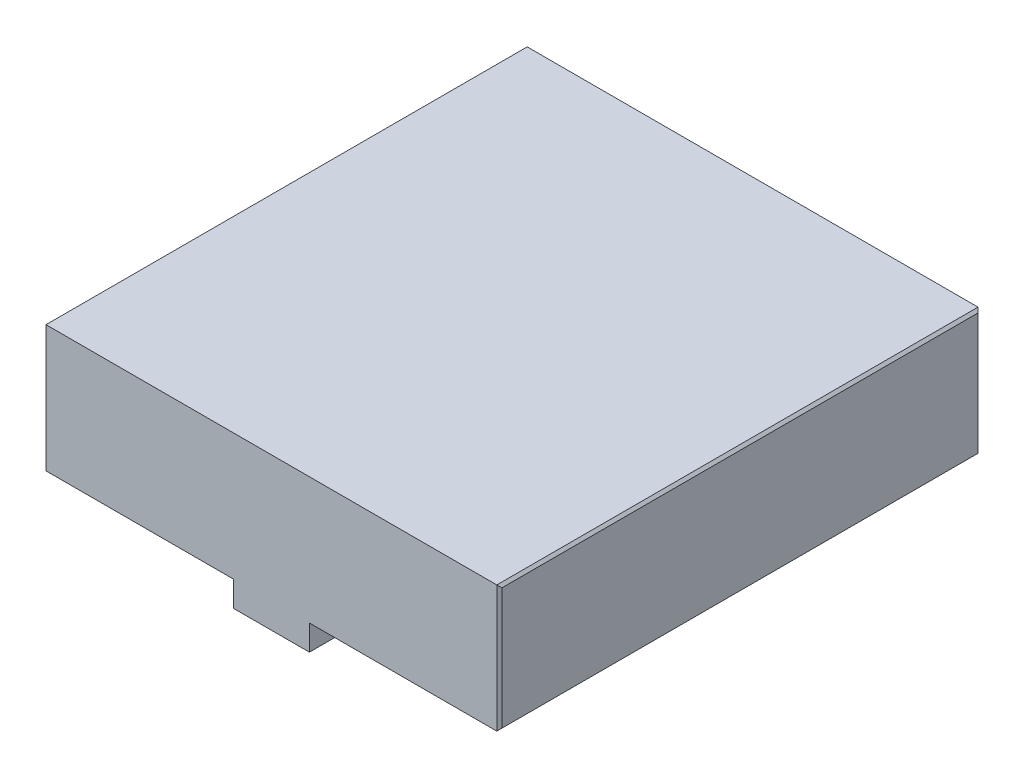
ISO-10303-21;
HEADER;
FILE_DESCRIPTION(('STEP AP214'),'2;1');
FILE_NAME('part.step','',(''),(''),'','','');
FILE_SCHEMA(('AUTOMOTIVE_DESIGN { 1 0 10303 214 1 1 1 1 }'));
ENDSEC;
DATA;
#1=APPLICATION_CONTEXT('core data for automotive mechanical design processes');
#2=APPLICATION_PROTOCOL_DEFINITION('international standard','automotive_design',2000,#1);
#3=PRODUCT_CONTEXT('',#1,'mechanical');
#4=PRODUCT('Part','Part','',(#3));
#5=PRODUCT_RELATED_PRODUCT_CATEGORY('part','',(#4));
#6=PRODUCT_DEFINITION_FORMATION('','',#4);
#7=PRODUCT_DEFINITION_CONTEXT('part definition',#1,'design');
#8=PRODUCT_DEFINITION('design','',#6,#7);
#9=PRODUCT_DEFINITION_SHAPE('','',#8);
#10=(LENGTH_UNIT() NAMED_UNIT(*) SI_UNIT(.MILLI.,.METRE.));
#11=(NAMED_UNIT(*) PLANE_ANGLE_UNIT() SI_UNIT($,.RADIAN.));
#12=(NAMED_UNIT(*) SI_UNIT($,.STERADIAN.) SOLID_ANGLE_UNIT());
#13=UNCERTAINTY_MEASURE_WITH_UNIT(LENGTH_MEASURE(1.E-05),#10,'distance_accuracy_value','');
#14=(GEOMETRIC_REPRESENTATION_CONTEXT(3) GLOBAL_UNCERTAINTY_ASSIGNED_CONTEXT((#13)) GLOBAL_UNIT_ASSIGNED_CONTEXT((#10,
#11,#12)) REPRESENTATION_CONTEXT('',''));
#15=CARTESIAN_POINT('',(0.,0.,0.));
#16=DIRECTION('',(0.,0.,1.));
#17=DIRECTION('',(1.,0.,0.));
#18=AXIS2_PLACEMENT_3D('',#15,#16,#17);
#19=CARTESIAN_POINT('',(-7.5,5.,95.));
#20=DIRECTION('',(1.,0.,0.));
#21=DIRECTION('',(0.,1.,0.));
#22=AXIS2_PLACEMENT_3D('',#19,#20,#21);
#23=PLANE('',#22);
#24=DIRECTION('',(0.,-1.,0.));
#25=VECTOR('',#24,1.);
#26=CARTESIAN_POINT('',(-7.5,5.,0.));
#27=LINE('',#26,#25);
#28=CARTESIAN_POINT('',(-7.5,5.,0.));
#29=VERTEX_POINT('',#28);
#30=CARTESIAN_POINT('',(-7.5,0.,0.));
#31=VERTEX_POINT('',#30);
#32=EDGE_CURVE('E120',#29,#31,#27,.T.);
#33=ORIENTED_EDGE('',*,*,#32,.T.);
#34=DIRECTION('',(0.,0.,-1.));
#35=VECTOR('',#34,1.);
#36=CARTESIAN_POINT('',(-7.5,0.,95.));
#37=LINE('',#36,#35);
#38=CARTESIAN_POINT('',(-7.5,0.,95.));
#39=VERTEX_POINT('',#38);
#40=EDGE_CURVE('E128',#39,#31,#37,.T.);
#41=ORIENTED_EDGE('',*,*,#40,.F.);
#42=DIRECTION('',(0.,-1.,0.));
#43=VECTOR('',#42,1.);
#44=CARTESIAN_POINT('',(-7.5,5.,95.));
#45=LINE('',#44,#43);
#46=CARTESIAN_POINT('',(-7.5,5.,95.));
#47=VERTEX_POINT('',#46);
#48=EDGE_CURVE('E156',#47,#39,#45,.T.);
#49=ORIENTED_EDGE('',*,*,#48,.F.);
#50=DIRECTION('',(0.,0.,-1.));
#51=VECTOR('',#50,1.);
#52=CARTESIAN_POINT('',(-7.5,5.,95.));
#53=LINE('',#52,#51);
#54=EDGE_CURVE('E139',#47,#29,#53,.T.);
#55=ORIENTED_EDGE('',*,*,#54,.T.);
#56=EDGE_LOOP('',(#33,#41,#49,#55));
#57=FACE_BOUND('',#56,.T.);
#58=ADVANCED_FACE('F27',(#57),#23,.F.);
#59=CARTESIAN_POINT('',(-7.5,0.,95.));
#60=DIRECTION('',(0.,1.,0.));
#61=DIRECTION('',(0.,0.,1.));
#62=AXIS2_PLACEMENT_3D('',#59,#60,#61);
#63=PLANE('',#62);
#64=DIRECTION('',(1.,0.,0.));
#65=VECTOR('',#64,1.);
#66=CARTESIAN_POINT('',(-7.5,0.,0.));
#67=LINE('',#66,#65);
#68=CARTESIAN_POINT('',(7.5,0.,0.));
#69=VERTEX_POINT('',#68);
#70=EDGE_CURVE('E114',#31,#69,#67,.T.);
#71=ORIENTED_EDGE('',*,*,#70,.T.);
#72=DIRECTION('',(0.,0.,-1.));
#73=VECTOR('',#72,1.);
#74=CARTESIAN_POINT('',(7.5,0.,95.));
#75=LINE('',#74,#73);
#76=CARTESIAN_POINT('',(7.5,0.,95.));
#77=VERTEX_POINT('',#76);
#78=EDGE_CURVE('E135',#77,#69,#75,.T.);
#79=ORIENTED_EDGE('',*,*,#78,.F.);
#80=DIRECTION('',(1.,0.,0.));
#81=VECTOR('',#80,1.);
#82=CARTESIAN_POINT('',(-7.5,0.,95.));
#83=LINE('',#82,#81);
#84=EDGE_CURVE('E130',#39,#77,#83,.T.);
#85=ORIENTED_EDGE('',*,*,#84,.F.);
#86=ORIENTED_EDGE('',*,*,#40,.T.);
#87=EDGE_LOOP('',(#71,#79,#85,#86));
#88=FACE_BOUND('',#87,.T.);
#89=ADVANCED_FACE('F129',(#88),#63,.F.);
#90=CARTESIAN_POINT('',(7.5,0.,95.));
#91=DIRECTION('',(-1.,0.,0.));
#92=DIRECTION('',(0.,-1.,0.));
#93=AXIS2_PLACEMENT_3D('',#90,#91,#92);
#94=PLANE('',#93);
#95=DIRECTION('',(0.,1.,0.));
#96=VECTOR('',#95,1.);
#97=CARTESIAN_POINT('',(7.5,0.,0.));
#98=LINE('',#97,#96);
#99=CARTESIAN_POINT('',(7.5,5.,0.));
#100=VERTEX_POINT('',#99);
#101=EDGE_CURVE('E122',#69,#100,#98,.T.);
#102=ORIENTED_EDGE('',*,*,#101,.T.);
#103=DIRECTION('',(0.,0.,-1.));
#104=VECTOR('',#103,1.);
#105=CARTESIAN_POINT('',(7.5,5.,95.));
#106=LINE('',#105,#104);
#107=CARTESIAN_POINT('',(7.5,5.,95.));
#108=VERTEX_POINT('',#107);
#109=EDGE_CURVE('E170',#108,#100,#106,.T.);
#110=ORIENTED_EDGE('',*,*,#109,.F.);
#111=DIRECTION('',(0.,1.,0.));
#112=VECTOR('',#111,1.);
#113=CARTESIAN_POINT('',(7.5,0.,95.));
#114=LINE('',#113,#112);
#115=EDGE_CURVE('E159',#77,#108,#114,.T.);
#116=ORIENTED_EDGE('',*,*,#115,.F.);
#117=ORIENTED_EDGE('',*,*,#78,.T.);
#118=EDGE_LOOP('',(#102,#110,#116,#117));
#119=FACE_BOUND('',#118,.T.);
#120=ADVANCED_FACE('F259',(#119),#94,.F.);
#121=CARTESIAN_POINT('',(7.5,5.,95.));
#122=DIRECTION('',(0.,1.,0.));
#123=DIRECTION('',(-1.,0.,0.));
#124=AXIS2_PLACEMENT_3D('',#121,#122,#123);
#125=PLANE('',#124);
#126=DIRECTION('',(1.,0.,0.));
#127=VECTOR('',#126,1.);
#128=CARTESIAN_POINT('',(7.5,5.,0.));
#129=LINE('',#128,#127);
#130=CARTESIAN_POINT('',(44.5,5.,0.));
#131=VERTEX_POINT('',#130);
#132=EDGE_CURVE('E148',#100,#131,#129,.T.);
#133=ORIENTED_EDGE('',*,*,#132,.T.);
#134=DIRECTION('',(0.,0.,1.));
#135=VECTOR('',#134,1.);
#136=CARTESIAN_POINT('',(44.5,5.,95.));
#137=LINE('',#136,#135);
#138=CARTESIAN_POINT('',(44.5,5.,95.));
#139=VERTEX_POINT('',#138);
#140=EDGE_CURVE('E182',#131,#139,#137,.T.);
#141=ORIENTED_EDGE('',*,*,#140,.T.);
#142=DIRECTION('',(1.,0.,0.));
#143=VECTOR('',#142,1.);
#144=CARTESIAN_POINT('',(7.5,5.,95.));
#145=LINE('',#144,#143);
#146=EDGE_CURVE('E161',#108,#139,#145,.T.);
#147=ORIENTED_EDGE('',*,*,#146,.F.);
#148=ORIENTED_EDGE('',*,*,#109,.T.);
#149=EDGE_LOOP('',(#133,#141,#147,#148));
#150=FACE_BOUND('',#149,.T.);
#151=ADVANCED_FACE('F252',(#150),#125,.F.);
#152=CARTESIAN_POINT('',(45.,5.,95.));
#153=DIRECTION('',(-1.,0.,0.));
#154=DIRECTION('',(0.,0.,1.));
#155=AXIS2_PLACEMENT_3D('',#152,#153,#154);
#156=PLANE('',#155);
#157=DIRECTION('',(0.,-1.,0.));
#158=VECTOR('',#157,1.);
#159=CARTESIAN_POINT('',(45.,5.,94.5));
#160=LINE('',#159,#158);
#161=CARTESIAN_POINT('',(45.,29.5,94.5));
#162=VERTEX_POINT('',#161);
#163=CARTESIAN_POINT('',(45.,5.5,94.5));
#164=VERTEX_POINT('',#163);
#165=EDGE_CURVE('E177',#162,#164,#160,.T.);
#166=ORIENTED_EDGE('',*,*,#165,.T.);
#167=DIRECTION('',(0.,0.,-1.));
#168=VECTOR('',#167,1.);
#169=CARTESIAN_POINT('',(45.,5.5,95.));
#170=LINE('',#169,#168);
#171=CARTESIAN_POINT('',(45.,5.5,0.5));
#172=VERTEX_POINT('',#171);
#173=EDGE_CURVE('E179',#164,#172,#170,.T.);
#174=ORIENTED_EDGE('',*,*,#173,.T.);
#175=DIRECTION('',(0.,1.,0.));
#176=VECTOR('',#175,1.);
#177=CARTESIAN_POINT('',(45.,30.,0.5));
#178=LINE('',#177,#176);
#179=CARTESIAN_POINT('',(45.,29.5,0.5));
#180=VERTEX_POINT('',#179);
#181=EDGE_CURVE('E134',#172,#180,#178,.T.);
#182=ORIENTED_EDGE('',*,*,#181,.T.);
#183=DIRECTION('',(0.,0.,1.));
#184=VECTOR('',#183,1.);
#185=CARTESIAN_POINT('',(45.,29.5,95.));
#186=LINE('',#185,#184);
#187=EDGE_CURVE('E175',#180,#162,#186,.T.);
#188=ORIENTED_EDGE('',*,*,#187,.T.);
#189=EDGE_LOOP('',(#166,#174,#182,#188));
#190=FACE_BOUND('',#189,.T.);
#191=ADVANCED_FACE('F243',(#190),#156,.F.);
#192=CARTESIAN_POINT('',(45.,30.,95.));
#193=DIRECTION('',(0.,-1.,0.));
#194=DIRECTION('',(1.,0.,0.));
#195=AXIS2_PLACEMENT_3D('',#192,#193,#194);
#196=PLANE('',#195);
#197=DIRECTION('',(-1.,0.,0.));
#198=VECTOR('',#197,1.);
#199=CARTESIAN_POINT('',(45.,30.,95.));
#200=LINE('',#199,#198);
#201=CARTESIAN_POINT('',(44.5,30.,95.));
#202=VERTEX_POINT('',#201);
#203=CARTESIAN_POINT('',(-44.5,30.,95.));
#204=VERTEX_POINT('',#203);
#205=EDGE_CURVE('E164',#202,#204,#200,.T.);
#206=ORIENTED_EDGE('',*,*,#205,.F.);
#207=DIRECTION('',(0.,0.,-1.));
#208=VECTOR('',#207,1.);
#209=CARTESIAN_POINT('',(44.5,30.,95.));
#210=LINE('',#209,#208);
#211=CARTESIAN_POINT('',(44.5,30.,0.));
#212=VERTEX_POINT('',#211);
#213=EDGE_CURVE('E192',#202,#212,#210,.T.);
#214=ORIENTED_EDGE('',*,*,#213,.T.);
#215=DIRECTION('',(-1.,0.,0.));
#216=VECTOR('',#215,1.);
#217=CARTESIAN_POINT('',(45.,30.,0.));
#218=LINE('',#217,#216);
#219=CARTESIAN_POINT('',(-44.5,30.,0.));
#220=VERTEX_POINT('',#219);
#221=EDGE_CURVE('E151',#212,#220,#218,.T.);
#222=ORIENTED_EDGE('',*,*,#221,.T.);
#223=DIRECTION('',(0.,0.,1.));
#224=VECTOR('',#223,1.);
#225=CARTESIAN_POINT('',(-44.5,30.,95.));
#226=LINE('',#225,#224);
#227=EDGE_CURVE('E189',#220,#204,#226,.T.);
#228=ORIENTED_EDGE('',*,*,#227,.T.);
#229=EDGE_LOOP('',(#206,#214,#222,#228));
#230=FACE_BOUND('',#229,.T.);
#231=ADVANCED_FACE('F261',(#230),#196,.F.);
#232=CARTESIAN_POINT('',(-45.,30.,95.));
#233=DIRECTION('',(1.,0.,0.));
#234=DIRECTION('',(0.,1.,0.));
#235=AXIS2_PLACEMENT_3D('',#232,#233,#234);
#236=PLANE('',#235);
#237=DIRECTION('',(0.,1.,0.));
#238=VECTOR('',#237,1.);
#239=CARTESIAN_POINT('',(-45.,30.,94.5));
#240=LINE('',#239,#238);
#241=CARTESIAN_POINT('',(-45.,5.5,94.5));
#242=VERTEX_POINT('',#241);
#243=CARTESIAN_POINT('',(-45.,29.5,94.5));
#244=VERTEX_POINT('',#243);
#245=EDGE_CURVE('E41',#242,#244,#240,.T.);
#246=ORIENTED_EDGE('',*,*,#245,.T.);
#247=DIRECTION('',(0.,0.,-1.));
#248=VECTOR('',#247,1.);
#249=CARTESIAN_POINT('',(-45.,29.5,95.));
#250=LINE('',#249,#248);
#251=CARTESIAN_POINT('',(-45.,29.5,0.5));
#252=VERTEX_POINT('',#251);
#253=EDGE_CURVE('E34',#244,#252,#250,.T.);
#254=ORIENTED_EDGE('',*,*,#253,.T.);
#255=DIRECTION('',(0.,-1.,0.));
#256=VECTOR('',#255,1.);
#257=CARTESIAN_POINT('',(-45.,5.,0.5));
#258=LINE('',#257,#256);
#259=CARTESIAN_POINT('',(-45.,5.5,0.5));
#260=VERTEX_POINT('',#259);
#261=EDGE_CURVE('E198',#252,#260,#258,.T.);
#262=ORIENTED_EDGE('',*,*,#261,.T.);
#263=DIRECTION('',(0.,0.,1.));
#264=VECTOR('',#263,1.);
#265=CARTESIAN_POINT('',(-45.,5.5,95.));
#266=LINE('',#265,#264);
#267=EDGE_CURVE('E46',#260,#242,#266,.T.);
#268=ORIENTED_EDGE('',*,*,#267,.T.);
#269=EDGE_LOOP('',(#246,#254,#262,#268));
#270=FACE_BOUND('',#269,.T.);
#271=ADVANCED_FACE('F202',(#270),#236,.F.);
#272=CARTESIAN_POINT('',(-45.,5.,95.));
#273=DIRECTION('',(0.,1.,0.));
#274=DIRECTION('',(-1.,0.,0.));
#275=AXIS2_PLACEMENT_3D('',#272,#273,#274);
#276=PLANE('',#275);
#277=DIRECTION('',(1.,0.,0.));
#278=VECTOR('',#277,1.);
#279=CARTESIAN_POINT('',(-45.,5.,95.));
#280=LINE('',#279,#278);
#281=CARTESIAN_POINT('',(-44.5,5.,95.));
#282=VERTEX_POINT('',#281);
#283=EDGE_CURVE('E167',#282,#47,#280,.T.);
#284=ORIENTED_EDGE('',*,*,#283,.F.);
#285=DIRECTION('',(0.,0.,-1.));
#286=VECTOR('',#285,1.);
#287=CARTESIAN_POINT('',(-44.5,5.,95.));
#288=LINE('',#287,#286);
#289=CARTESIAN_POINT('',(-44.5,5.,0.));
#290=VERTEX_POINT('',#289);
#291=EDGE_CURVE('E11',#282,#290,#288,.T.);
#292=ORIENTED_EDGE('',*,*,#291,.T.);
#293=DIRECTION('',(1.,0.,0.));
#294=VECTOR('',#293,1.);
#295=CARTESIAN_POINT('',(-45.,5.,0.));
#296=LINE('',#295,#294);
#297=EDGE_CURVE('E154',#290,#29,#296,.T.);
#298=ORIENTED_EDGE('',*,*,#297,.T.);
#299=ORIENTED_EDGE('',*,*,#54,.F.);
#300=EDGE_LOOP('',(#284,#292,#298,#299));
#301=FACE_BOUND('',#300,.T.);
#302=ADVANCED_FACE('F265',(#301),#276,.F.);
#303=CARTESIAN_POINT('',(-7.49999999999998,30.,95.));
#304=DIRECTION('',(0.,0.,-1.));
#305=DIRECTION('',(-1.,0.,0.));
#306=AXIS2_PLACEMENT_3D('',#303,#304,#305);
#307=PLANE('',#306);
#308=ORIENTED_EDGE('',*,*,#146,.T.);
#309=DIRECTION('',(0.,1.,0.));
#310=VECTOR('',#309,1.);
#311=CARTESIAN_POINT('',(44.5,30.,95.));
#312=LINE('',#311,#310);
#313=EDGE_CURVE('E187',#139,#202,#312,.T.);
#314=ORIENTED_EDGE('',*,*,#313,.T.);
#315=ORIENTED_EDGE('',*,*,#205,.T.);
#316=DIRECTION('',(0.,-1.,0.));
#317=VECTOR('',#316,1.);
#318=CARTESIAN_POINT('',(-44.5,30.,95.));
#319=LINE('',#318,#317);
#320=EDGE_CURVE('E185',#204,#282,#319,.T.);
#321=ORIENTED_EDGE('',*,*,#320,.T.);
#322=ORIENTED_EDGE('',*,*,#283,.T.);
#323=ORIENTED_EDGE('',*,*,#48,.T.);
#324=ORIENTED_EDGE('',*,*,#84,.T.);
#325=ORIENTED_EDGE('',*,*,#115,.T.);
#326=EDGE_LOOP('',(#308,#314,#315,#321,#322,#323,#324,#325));
#327=FACE_BOUND('',#326,.T.);
#328=ADVANCED_FACE('F254',(#327),#307,.F.);
#329=CARTESIAN_POINT('',(-7.49999999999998,30.,0.));
#330=DIRECTION('',(0.,0.,-1.));
#331=DIRECTION('',(-1.,0.,0.));
#332=AXIS2_PLACEMENT_3D('',#329,#330,#331);
#333=PLANE('',#332);
#334=ORIENTED_EDGE('',*,*,#221,.F.);
#335=DIRECTION('',(0.,-1.,0.));
#336=VECTOR('',#335,1.);
#337=CARTESIAN_POINT('',(44.5,5.,0.));
#338=LINE('',#337,#336);
#339=EDGE_CURVE('E196',#212,#131,#338,.T.);
#340=ORIENTED_EDGE('',*,*,#339,.T.);
#341=ORIENTED_EDGE('',*,*,#132,.F.);
#342=ORIENTED_EDGE('',*,*,#101,.F.);
#343=ORIENTED_EDGE('',*,*,#70,.F.);
#344=ORIENTED_EDGE('',*,*,#32,.F.);
#345=ORIENTED_EDGE('',*,*,#297,.F.);
#346=DIRECTION('',(0.,1.,0.));
#347=VECTOR('',#346,1.);
#348=CARTESIAN_POINT('',(-44.5,30.,0.));
#349=LINE('',#348,#347);
#350=EDGE_CURVE('E194',#290,#220,#349,.T.);
#351=ORIENTED_EDGE('',*,*,#350,.T.);
#352=EDGE_LOOP('',(#334,#340,#341,#342,#343,#344,#345,#351));
#353=FACE_BOUND('',#352,.T.);
#354=ADVANCED_FACE('F117',(#353),#333,.T.);
#355=CARTESIAN_POINT('',(44.5,30.,95.));
#356=DIRECTION('',(-0.707106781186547,-0.707106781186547,0.));
#357=DIRECTION('',(0.707106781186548,-0.707106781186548,0.));
#358=AXIS2_PLACEMENT_3D('',#355,#356,#357);
#359=PLANE('',#358);
#360=DIRECTION('',(-0.577350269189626,0.577350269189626,-0.577350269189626));
#361=VECTOR('',#360,1.);
#362=CARTESIAN_POINT('',(53.1666666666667,21.3333333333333,8.66666666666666));
#363=LINE('',#362,#361);
#364=EDGE_CURVE('E143',#212,#180,#363,.F.);
#365=ORIENTED_EDGE('',*,*,#364,.F.);
#366=ORIENTED_EDGE('',*,*,#213,.F.);
#367=DIRECTION('',(0.577350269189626,-0.577350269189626,-0.577350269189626));
#368=VECTOR('',#367,1.);
#369=CARTESIAN_POINT('',(44.5,30.,95.));
#370=LINE('',#369,#368);
#371=EDGE_CURVE('E140',#162,#202,#370,.F.);
#372=ORIENTED_EDGE('',*,*,#371,.F.);
#373=ORIENTED_EDGE('',*,*,#187,.F.);
#374=EDGE_LOOP('',(#365,#366,#372,#373));
#375=FACE_BOUND('',#374,.T.);
#376=ADVANCED_FACE('F239',(#375),#359,.F.);
#377=CARTESIAN_POINT('',(44.5,30.,95.));
#378=DIRECTION('',(-0.707106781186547,0.,-0.707106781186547));
#379=DIRECTION('',(-0.707106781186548,0.,0.707106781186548));
#380=AXIS2_PLACEMENT_3D('',#377,#378,#379);
#381=PLANE('',#380);
#382=ORIENTED_EDGE('',*,*,#371,.T.);
#383=ORIENTED_EDGE('',*,*,#313,.F.);
#384=DIRECTION('',(0.577350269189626,0.577350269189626,-0.577350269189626));
#385=VECTOR('',#384,1.);
#386=CARTESIAN_POINT('',(52.8333333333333,13.3333333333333,86.6666666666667));
#387=LINE('',#386,#385);
#388=EDGE_CURVE('E228',#164,#139,#387,.F.);
#389=ORIENTED_EDGE('',*,*,#388,.F.);
#390=ORIENTED_EDGE('',*,*,#165,.F.);
#391=EDGE_LOOP('',(#382,#383,#389,#390));
#392=FACE_BOUND('',#391,.T.);
#393=ADVANCED_FACE('F301',(#392),#381,.F.);
#394=CARTESIAN_POINT('',(45.,5.,0.5));
#395=DIRECTION('',(0.707106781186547,0.,-0.707106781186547));
#396=DIRECTION('',(-0.707106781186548,0.,-0.707106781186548));
#397=AXIS2_PLACEMENT_3D('',#394,#395,#396);
#398=PLANE('',#397);
#399=ORIENTED_EDGE('',*,*,#364,.T.);
#400=ORIENTED_EDGE('',*,*,#181,.F.);
#401=DIRECTION('',(0.577350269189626,0.577350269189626,0.577350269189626));
#402=VECTOR('',#401,1.);
#403=CARTESIAN_POINT('',(44.8333333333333,5.33333333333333,0.333333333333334));
#404=LINE('',#403,#402);
#405=EDGE_CURVE('E223',#131,#172,#404,.T.);
#406=ORIENTED_EDGE('',*,*,#405,.F.);
#407=ORIENTED_EDGE('',*,*,#339,.F.);
#408=EDGE_LOOP('',(#399,#400,#406,#407));
#409=FACE_BOUND('',#408,.T.);
#410=ADVANCED_FACE('F234',(#409),#398,.T.);
#411=CARTESIAN_POINT('',(45.,5.5,95.));
#412=DIRECTION('',(-0.707106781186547,0.707106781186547,0.));
#413=DIRECTION('',(-0.707106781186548,-0.707106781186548,0.));
#414=AXIS2_PLACEMENT_3D('',#411,#412,#413);
#415=PLANE('',#414);
#416=ORIENTED_EDGE('',*,*,#388,.T.);
#417=ORIENTED_EDGE('',*,*,#140,.F.);
#418=ORIENTED_EDGE('',*,*,#405,.T.);
#419=ORIENTED_EDGE('',*,*,#173,.F.);
#420=EDGE_LOOP('',(#416,#417,#418,#419));
#421=FACE_BOUND('',#420,.T.);
#422=ADVANCED_FACE('F247',(#421),#415,.F.);
#423=CARTESIAN_POINT('',(-44.5,5.,95.));
#424=DIRECTION('',(0.707106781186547,0.707106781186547,0.));
#425=DIRECTION('',(-0.707106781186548,0.707106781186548,0.));
#426=AXIS2_PLACEMENT_3D('',#423,#424,#425);
#427=PLANE('',#426);
#428=DIRECTION('',(0.577350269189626,-0.577350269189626,-0.577350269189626));
#429=VECTOR('',#428,1.);
#430=CARTESIAN_POINT('',(-53.1666666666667,13.6666666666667,8.66666666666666));
#431=LINE('',#430,#429);
#432=EDGE_CURVE('E217',#290,#260,#431,.F.);
#433=ORIENTED_EDGE('',*,*,#432,.F.);
#434=ORIENTED_EDGE('',*,*,#291,.F.);
#435=DIRECTION('',(-0.577350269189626,0.577350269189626,-0.577350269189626));
#436=VECTOR('',#435,1.);
#437=CARTESIAN_POINT('',(-44.5,5.,95.));
#438=LINE('',#437,#436);
#439=EDGE_CURVE('E220',#242,#282,#438,.F.);
#440=ORIENTED_EDGE('',*,*,#439,.F.);
#441=ORIENTED_EDGE('',*,*,#267,.F.);
#442=EDGE_LOOP('',(#433,#434,#440,#441));
#443=FACE_BOUND('',#442,.T.);
#444=ADVANCED_FACE('F266',(#443),#427,.F.);
#445=CARTESIAN_POINT('',(-44.5,30.,95.));
#446=DIRECTION('',(0.707106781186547,0.,-0.707106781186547));
#447=DIRECTION('',(-0.707106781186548,0.,-0.707106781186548));
#448=AXIS2_PLACEMENT_3D('',#445,#446,#447);
#449=PLANE('',#448);
#450=ORIENTED_EDGE('',*,*,#439,.T.);
#451=ORIENTED_EDGE('',*,*,#320,.F.);
#452=DIRECTION('',(-0.577350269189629,-0.577350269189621,-0.577350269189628));
#453=VECTOR('',#452,1.);
#454=CARTESIAN_POINT('',(-44.5,30.,95.));
#455=LINE('',#454,#453);
#456=EDGE_CURVE('E207',#244,#204,#455,.F.);
#457=ORIENTED_EDGE('',*,*,#456,.F.);
#458=ORIENTED_EDGE('',*,*,#245,.F.);
#459=EDGE_LOOP('',(#450,#451,#457,#458));
#460=FACE_BOUND('',#459,.T.);
#461=ADVANCED_FACE('F267',(#460),#449,.F.);
#462=CARTESIAN_POINT('',(-45.,30.,0.5));
#463=DIRECTION('',(-0.707106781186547,0.,-0.707106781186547));
#464=DIRECTION('',(-0.707106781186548,0.,0.707106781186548));
#465=AXIS2_PLACEMENT_3D('',#462,#463,#464);
#466=PLANE('',#465);
#467=ORIENTED_EDGE('',*,*,#432,.T.);
#468=ORIENTED_EDGE('',*,*,#261,.F.);
#469=DIRECTION('',(-0.577350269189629,-0.577350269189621,0.577350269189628));
#470=VECTOR('',#469,1.);
#471=CARTESIAN_POINT('',(-44.8333333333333,29.6666666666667,0.333333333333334));
#472=LINE('',#471,#470);
#473=EDGE_CURVE('E210',#220,#252,#472,.T.);
#474=ORIENTED_EDGE('',*,*,#473,.F.);
#475=ORIENTED_EDGE('',*,*,#350,.F.);
#476=EDGE_LOOP('',(#467,#468,#474,#475));
#477=FACE_BOUND('',#476,.T.);
#478=ADVANCED_FACE('F215',(#477),#466,.T.);
#479=CARTESIAN_POINT('',(-45.,29.5,95.));
#480=DIRECTION('',(0.707106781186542,-0.707106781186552,0.));
#481=DIRECTION('',(0.707106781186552,0.707106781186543,0.));
#482=AXIS2_PLACEMENT_3D('',#479,#480,#481);
#483=PLANE('',#482);
#484=ORIENTED_EDGE('',*,*,#456,.T.);
#485=ORIENTED_EDGE('',*,*,#227,.F.);
#486=ORIENTED_EDGE('',*,*,#473,.T.);
#487=ORIENTED_EDGE('',*,*,#253,.F.);
#488=EDGE_LOOP('',(#484,#485,#486,#487));
#489=FACE_BOUND('',#488,.T.);
#490=ADVANCED_FACE('F205',(#489),#483,.F.);
#491=CLOSED_SHELL('',(#58,#89,#120,#151,#191,#231,#271,#302,#328,#354,#376,#393,#410,#422,#444,
#461,#478,#490));
#492=MANIFOLD_SOLID_BREP('B2',#491);
#493=ADVANCED_BREP_SHAPE_REPRESENTATION('',(#18,#492),#14);
#494=SHAPE_DEFINITION_REPRESENTATION(#9,#493);
ENDSEC;
END-ISO-10303-21;
